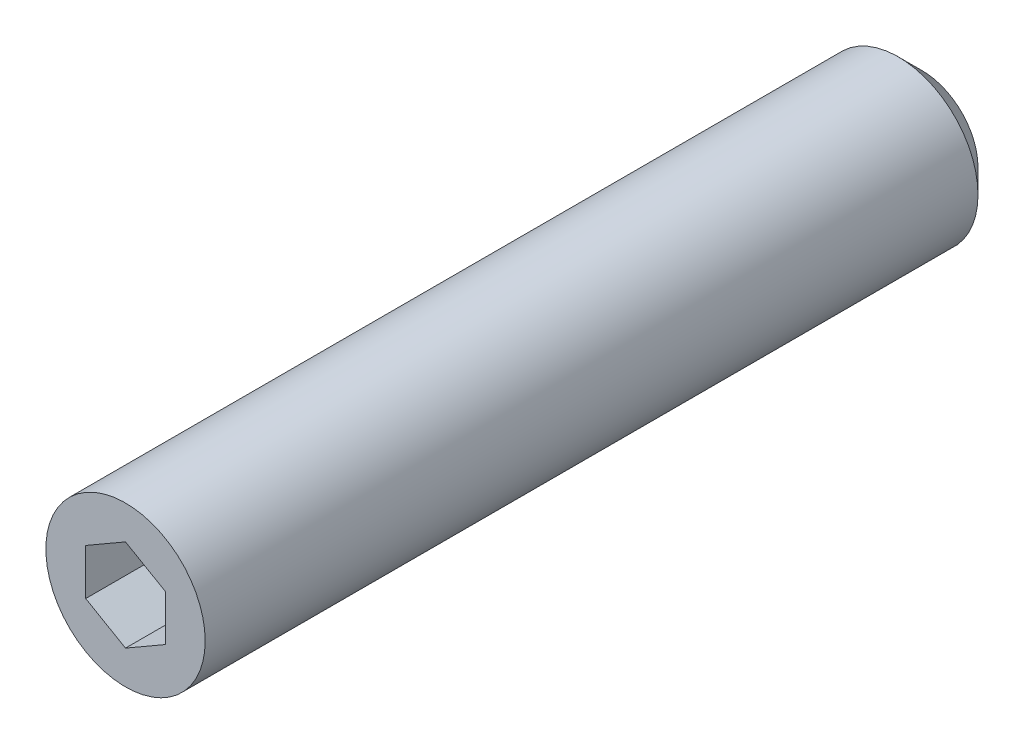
ISO-10303-21;
HEADER;
FILE_DESCRIPTION(('STEP AP214'),'2;1');
FILE_NAME('part.step','',(''),(''),'','','');
FILE_SCHEMA(('AUTOMOTIVE_DESIGN { 1 0 10303 214 1 1 1 1 }'));
ENDSEC;
DATA;
#1=APPLICATION_CONTEXT('core data for automotive mechanical design processes');
#2=APPLICATION_PROTOCOL_DEFINITION('international standard','automotive_design',2000,#1);
#3=PRODUCT_CONTEXT('',#1,'mechanical');
#4=PRODUCT('Part','Part','',(#3));
#5=PRODUCT_RELATED_PRODUCT_CATEGORY('part','',(#4));
#6=PRODUCT_DEFINITION_FORMATION('','',#4);
#7=PRODUCT_DEFINITION_CONTEXT('part definition',#1,'design');
#8=PRODUCT_DEFINITION('design','',#6,#7);
#9=PRODUCT_DEFINITION_SHAPE('','',#8);
#10=(LENGTH_UNIT() NAMED_UNIT(*) SI_UNIT(.MILLI.,.METRE.));
#11=(NAMED_UNIT(*) PLANE_ANGLE_UNIT() SI_UNIT($,.RADIAN.));
#12=(NAMED_UNIT(*) SI_UNIT($,.STERADIAN.) SOLID_ANGLE_UNIT());
#13=UNCERTAINTY_MEASURE_WITH_UNIT(LENGTH_MEASURE(1.E-05),#10,'distance_accuracy_value','');
#14=(GEOMETRIC_REPRESENTATION_CONTEXT(3) GLOBAL_UNCERTAINTY_ASSIGNED_CONTEXT((#13)) GLOBAL_UNIT_ASSIGNED_CONTEXT((#10,
#11,#12)) REPRESENTATION_CONTEXT('',''));
#15=CARTESIAN_POINT('',(0.,0.,0.));
#16=DIRECTION('',(0.,0.,1.));
#17=DIRECTION('',(1.,0.,0.));
#18=AXIS2_PLACEMENT_3D('',#15,#16,#17);
#19=CARTESIAN_POINT('',(0.,2.30940107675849,36.));
#20=DIRECTION('',(-0.5,-0.866025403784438,0.));
#21=DIRECTION('',(0.866025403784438,-0.5,0.));
#22=AXIS2_PLACEMENT_3D('',#19,#20,#21);
#23=PLANE('',#22);
#24=DIRECTION('',(0.,0.,1.));
#25=VECTOR('',#24,1.);
#26=CARTESIAN_POINT('',(2.,1.15470053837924,36.));
#27=LINE('',#26,#25);
#28=CARTESIAN_POINT('',(2.,1.15470053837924,36.));
#29=VERTEX_POINT('',#28);
#30=CARTESIAN_POINT('',(2.,1.15470053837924,40.));
#31=VERTEX_POINT('',#30);
#32=EDGE_CURVE('E63',#29,#31,#27,.T.);
#33=ORIENTED_EDGE('',*,*,#32,.T.);
#34=DIRECTION('',(0.866025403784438,-0.5,0.));
#35=VECTOR('',#34,1.);
#36=CARTESIAN_POINT('',(0.,2.30940107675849,40.));
#37=LINE('',#36,#35);
#38=CARTESIAN_POINT('',(0.,2.30940107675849,40.));
#39=VERTEX_POINT('',#38);
#40=EDGE_CURVE('E29',#39,#31,#37,.T.);
#41=ORIENTED_EDGE('',*,*,#40,.F.);
#42=DIRECTION('',(0.,0.,1.));
#43=VECTOR('',#42,1.);
#44=CARTESIAN_POINT('',(0.,2.30940107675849,36.));
#45=LINE('',#44,#43);
#46=CARTESIAN_POINT('',(0.,2.30940107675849,36.));
#47=VERTEX_POINT('',#46);
#48=EDGE_CURVE('E33',#47,#39,#45,.T.);
#49=ORIENTED_EDGE('',*,*,#48,.F.);
#50=DIRECTION('',(0.866025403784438,-0.5,0.));
#51=VECTOR('',#50,1.);
#52=CARTESIAN_POINT('',(0.,2.30940107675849,36.));
#53=LINE('',#52,#51);
#54=EDGE_CURVE('E65',#47,#29,#53,.T.);
#55=ORIENTED_EDGE('',*,*,#54,.T.);
#56=EDGE_LOOP('',(#33,#41,#49,#55));
#57=FACE_BOUND('',#56,.T.);
#58=ADVANCED_FACE('F14',(#57),#23,.T.);
#59=CARTESIAN_POINT('',(2.,1.15470053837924,36.));
#60=DIRECTION('',(-1.,0.,0.));
#61=DIRECTION('',(0.,-1.,0.));
#62=AXIS2_PLACEMENT_3D('',#59,#60,#61);
#63=PLANE('',#62);
#64=DIRECTION('',(0.,0.,1.));
#65=VECTOR('',#64,1.);
#66=CARTESIAN_POINT('',(2.,-1.15470053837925,36.));
#67=LINE('',#66,#65);
#68=CARTESIAN_POINT('',(2.,-1.15470053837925,36.));
#69=VERTEX_POINT('',#68);
#70=CARTESIAN_POINT('',(2.,-1.15470053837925,40.));
#71=VERTEX_POINT('',#70);
#72=EDGE_CURVE('E70',#69,#71,#67,.T.);
#73=ORIENTED_EDGE('',*,*,#72,.T.);
#74=DIRECTION('',(0.,-1.,0.));
#75=VECTOR('',#74,1.);
#76=CARTESIAN_POINT('',(2.,1.15470053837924,40.));
#77=LINE('',#76,#75);
#78=EDGE_CURVE('E73',#31,#71,#77,.T.);
#79=ORIENTED_EDGE('',*,*,#78,.F.);
#80=ORIENTED_EDGE('',*,*,#32,.F.);
#81=DIRECTION('',(0.,-1.,0.));
#82=VECTOR('',#81,1.);
#83=CARTESIAN_POINT('',(2.,1.15470053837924,36.));
#84=LINE('',#83,#82);
#85=EDGE_CURVE('E100',#29,#69,#84,.T.);
#86=ORIENTED_EDGE('',*,*,#85,.T.);
#87=EDGE_LOOP('',(#73,#79,#80,#86));
#88=FACE_BOUND('',#87,.T.);
#89=ADVANCED_FACE('F74',(#88),#63,.T.);
#90=CARTESIAN_POINT('',(0.,-2.30940107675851,36.));
#91=DIRECTION('',(0.5,-0.866025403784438,0.));
#92=DIRECTION('',(0.866025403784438,0.5,0.));
#93=AXIS2_PLACEMENT_3D('',#90,#91,#92);
#94=PLANE('',#93);
#95=DIRECTION('',(0.,0.,1.));
#96=VECTOR('',#95,1.);
#97=CARTESIAN_POINT('',(0.,-2.30940107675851,36.));
#98=LINE('',#97,#96);
#99=CARTESIAN_POINT('',(0.,-2.30940107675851,36.));
#100=VERTEX_POINT('',#99);
#101=CARTESIAN_POINT('',(0.,-2.30940107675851,40.));
#102=VERTEX_POINT('',#101);
#103=EDGE_CURVE('E108',#100,#102,#98,.T.);
#104=ORIENTED_EDGE('',*,*,#103,.T.);
#105=DIRECTION('',(0.866025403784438,0.5,0.));
#106=VECTOR('',#105,1.);
#107=CARTESIAN_POINT('',(0.,-2.30940107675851,40.));
#108=LINE('',#107,#106);
#109=EDGE_CURVE('E78',#102,#71,#108,.T.);
#110=ORIENTED_EDGE('',*,*,#109,.T.);
#111=ORIENTED_EDGE('',*,*,#72,.F.);
#112=DIRECTION('',(0.866025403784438,0.5,0.));
#113=VECTOR('',#112,1.);
#114=CARTESIAN_POINT('',(0.,-2.30940107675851,36.));
#115=LINE('',#114,#113);
#116=EDGE_CURVE('E97',#100,#69,#115,.T.);
#117=ORIENTED_EDGE('',*,*,#116,.F.);
#118=EDGE_LOOP('',(#104,#110,#111,#117));
#119=FACE_BOUND('',#118,.T.);
#120=ADVANCED_FACE('F135',(#119),#94,.F.);
#121=CARTESIAN_POINT('',(0.,-2.30940107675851,36.));
#122=DIRECTION('',(0.5,0.866025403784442,0.));
#123=DIRECTION('',(-0.866025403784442,0.5,0.));
#124=AXIS2_PLACEMENT_3D('',#121,#122,#123);
#125=PLANE('',#124);
#126=DIRECTION('',(0.,0.,1.));
#127=VECTOR('',#126,1.);
#128=CARTESIAN_POINT('',(-2.,-1.15470053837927,36.));
#129=LINE('',#128,#127);
#130=CARTESIAN_POINT('',(-2.,-1.15470053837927,36.));
#131=VERTEX_POINT('',#130);
#132=CARTESIAN_POINT('',(-2.,-1.15470053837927,40.));
#133=VERTEX_POINT('',#132);
#134=EDGE_CURVE('E106',#131,#133,#129,.T.);
#135=ORIENTED_EDGE('',*,*,#134,.T.);
#136=DIRECTION('',(-0.866025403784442,0.5,0.));
#137=VECTOR('',#136,1.);
#138=CARTESIAN_POINT('',(0.,-2.30940107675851,40.));
#139=LINE('',#138,#137);
#140=EDGE_CURVE('E173',#102,#133,#139,.T.);
#141=ORIENTED_EDGE('',*,*,#140,.F.);
#142=ORIENTED_EDGE('',*,*,#103,.F.);
#143=DIRECTION('',(-0.866025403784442,0.5,0.));
#144=VECTOR('',#143,1.);
#145=CARTESIAN_POINT('',(0.,-2.30940107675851,36.));
#146=LINE('',#145,#144);
#147=EDGE_CURVE('E94',#100,#131,#146,.T.);
#148=ORIENTED_EDGE('',*,*,#147,.T.);
#149=EDGE_LOOP('',(#135,#141,#142,#148));
#150=FACE_BOUND('',#149,.T.);
#151=ADVANCED_FACE('F147',(#150),#125,.T.);
#152=CARTESIAN_POINT('',(-2.,1.15470053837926,36.));
#153=DIRECTION('',(-1.,0.,0.));
#154=DIRECTION('',(0.,-1.,0.));
#155=AXIS2_PLACEMENT_3D('',#152,#153,#154);
#156=PLANE('',#155);
#157=DIRECTION('',(0.,0.,1.));
#158=VECTOR('',#157,1.);
#159=CARTESIAN_POINT('',(-2.,1.15470053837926,36.));
#160=LINE('',#159,#158);
#161=CARTESIAN_POINT('',(-2.,1.15470053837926,36.));
#162=VERTEX_POINT('',#161);
#163=CARTESIAN_POINT('',(-2.,1.15470053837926,40.));
#164=VERTEX_POINT('',#163);
#165=EDGE_CURVE('E104',#162,#164,#160,.T.);
#166=ORIENTED_EDGE('',*,*,#165,.T.);
#167=DIRECTION('',(0.,-1.,0.));
#168=VECTOR('',#167,1.);
#169=CARTESIAN_POINT('',(-2.,1.15470053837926,40.));
#170=LINE('',#169,#168);
#171=EDGE_CURVE('E174',#164,#133,#170,.T.);
#172=ORIENTED_EDGE('',*,*,#171,.T.);
#173=ORIENTED_EDGE('',*,*,#134,.F.);
#174=DIRECTION('',(0.,-1.,0.));
#175=VECTOR('',#174,1.);
#176=CARTESIAN_POINT('',(-2.,1.15470053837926,36.));
#177=LINE('',#176,#175);
#178=EDGE_CURVE('E91',#162,#131,#177,.T.);
#179=ORIENTED_EDGE('',*,*,#178,.F.);
#180=EDGE_LOOP('',(#166,#172,#173,#179));
#181=FACE_BOUND('',#180,.T.);
#182=ADVANCED_FACE('F143',(#181),#156,.F.);
#183=CARTESIAN_POINT('',(0.,2.30940107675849,36.));
#184=DIRECTION('',(-0.499999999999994,0.866025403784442,0.));
#185=DIRECTION('',(-0.866025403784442,-0.499999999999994,0.));
#186=AXIS2_PLACEMENT_3D('',#183,#184,#185);
#187=PLANE('',#186);
#188=DIRECTION('',(-0.866025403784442,-0.499999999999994,0.));
#189=VECTOR('',#188,1.);
#190=CARTESIAN_POINT('',(0.,2.30940107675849,36.));
#191=LINE('',#190,#189);
#192=EDGE_CURVE('E88',#47,#162,#191,.T.);
#193=ORIENTED_EDGE('',*,*,#192,.F.);
#194=ORIENTED_EDGE('',*,*,#48,.T.);
#195=DIRECTION('',(-0.866025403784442,-0.499999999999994,0.));
#196=VECTOR('',#195,1.);
#197=CARTESIAN_POINT('',(0.,2.30940107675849,40.));
#198=LINE('',#197,#196);
#199=EDGE_CURVE('E84',#39,#164,#198,.T.);
#200=ORIENTED_EDGE('',*,*,#199,.T.);
#201=ORIENTED_EDGE('',*,*,#165,.F.);
#202=EDGE_LOOP('',(#193,#194,#200,#201));
#203=FACE_BOUND('',#202,.T.);
#204=ADVANCED_FACE('F140',(#203),#187,.F.);
#205=CARTESIAN_POINT('',(4.,0.,36.));
#206=DIRECTION('',(0.,0.,1.));
#207=DIRECTION('',(1.,0.,0.));
#208=AXIS2_PLACEMENT_3D('',#205,#206,#207);
#209=PLANE('',#208);
#210=ORIENTED_EDGE('',*,*,#54,.F.);
#211=ORIENTED_EDGE('',*,*,#192,.T.);
#212=ORIENTED_EDGE('',*,*,#178,.T.);
#213=ORIENTED_EDGE('',*,*,#147,.F.);
#214=ORIENTED_EDGE('',*,*,#116,.T.);
#215=ORIENTED_EDGE('',*,*,#85,.F.);
#216=EDGE_LOOP('',(#210,#211,#212,#213,#214,#215));
#217=FACE_BOUND('',#216,.T.);
#218=ADVANCED_FACE('F139',(#217),#209,.T.);
#219=CARTESIAN_POINT('',(4.,0.,40.));
#220=DIRECTION('',(0.,0.,-1.));
#221=DIRECTION('',(-1.,0.,0.));
#222=AXIS2_PLACEMENT_3D('',#219,#220,#221);
#223=PLANE('',#222);
#224=CARTESIAN_POINT('',(0.,0.,40.));
#225=DIRECTION('',(0.,0.,1.));
#226=DIRECTION('',(1.,0.,0.));
#227=AXIS2_PLACEMENT_3D('',#224,#225,#226);
#228=CIRCLE('',#227,4.);
#229=CARTESIAN_POINT('',(4.,0.,40.));
#230=VERTEX_POINT('',#229);
#231=EDGE_CURVE('E69',#230,#230,#228,.T.);
#232=ORIENTED_EDGE('',*,*,#231,.T.);
#233=EDGE_LOOP('',(#232));
#234=FACE_BOUND('',#233,.T.);
#235=ORIENTED_EDGE('',*,*,#40,.T.);
#236=ORIENTED_EDGE('',*,*,#78,.T.);
#237=ORIENTED_EDGE('',*,*,#109,.F.);
#238=ORIENTED_EDGE('',*,*,#140,.T.);
#239=ORIENTED_EDGE('',*,*,#171,.F.);
#240=ORIENTED_EDGE('',*,*,#199,.F.);
#241=EDGE_LOOP('',(#235,#236,#237,#238,#239,#240));
#242=FACE_BOUND('',#241,.T.);
#243=ADVANCED_FACE('F81',(#234,#242),#223,.F.);
#244=CARTESIAN_POINT('',(0.,0.,0.));
#245=DIRECTION('',(0.,0.,1.));
#246=DIRECTION('',(1.,0.,0.));
#247=AXIS2_PLACEMENT_3D('',#244,#245,#246);
#248=PLANE('',#247);
#249=CARTESIAN_POINT('',(0.,0.,0.));
#250=DIRECTION('',(0.,0.,1.));
#251=DIRECTION('',(1.,0.,0.));
#252=AXIS2_PLACEMENT_3D('',#249,#250,#251);
#253=CIRCLE('',#252,2.8);
#254=CARTESIAN_POINT('',(2.8,0.,0.));
#255=VERTEX_POINT('',#254);
#256=EDGE_CURVE('E9',#255,#255,#253,.T.);
#257=ORIENTED_EDGE('',*,*,#256,.F.);
#258=EDGE_LOOP('',(#257));
#259=FACE_BOUND('',#258,.T.);
#260=ADVANCED_FACE('F16',(#259),#248,.F.);
#261=CARTESIAN_POINT('',(0.,0.,1.2));
#262=DIRECTION('',(0.,0.,1.));
#263=DIRECTION('',(1.,0.,0.));
#264=AXIS2_PLACEMENT_3D('',#261,#262,#263);
#265=CONICAL_SURFACE('',#264,4.,0.785398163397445);
#266=ORIENTED_EDGE('',*,*,#256,.T.);
#267=EDGE_LOOP('',(#266));
#268=FACE_BOUND('',#267,.T.);
#269=CARTESIAN_POINT('',(0.,0.,1.2));
#270=DIRECTION('',(0.,0.,1.));
#271=DIRECTION('',(1.,0.,0.));
#272=AXIS2_PLACEMENT_3D('',#269,#270,#271);
#273=CIRCLE('',#272,4.);
#274=CARTESIAN_POINT('',(4.,0.,1.2));
#275=VERTEX_POINT('',#274);
#276=EDGE_CURVE('E22',#275,#275,#273,.T.);
#277=ORIENTED_EDGE('',*,*,#276,.F.);
#278=EDGE_LOOP('',(#277));
#279=FACE_BOUND('',#278,.T.);
#280=ADVANCED_FACE('F117',(#268,#279),#265,.T.);
#281=CARTESIAN_POINT('',(0.,0.,110.));
#282=DIRECTION('',(0.,0.,1.));
#283=DIRECTION('',(1.,0.,0.));
#284=AXIS2_PLACEMENT_3D('',#281,#282,#283);
#285=CYLINDRICAL_SURFACE('',#284,4.);
#286=ORIENTED_EDGE('',*,*,#231,.F.);
#287=EDGE_LOOP('',(#286));
#288=FACE_BOUND('',#287,.T.);
#289=ORIENTED_EDGE('',*,*,#276,.T.);
#290=EDGE_LOOP('',(#289));
#291=FACE_BOUND('',#290,.T.);
#292=ADVANCED_FACE('F115',(#288,#291),#285,.T.);
#293=CLOSED_SHELL('',(#58,#89,#120,#151,#182,#204,#218,#243,#260,#280,#292));
#294=MANIFOLD_SOLID_BREP('B1',#293);
#295=ADVANCED_BREP_SHAPE_REPRESENTATION('',(#18,#294),#14);
#296=SHAPE_DEFINITION_REPRESENTATION(#9,#295);
ENDSEC;
END-ISO-10303-21;
